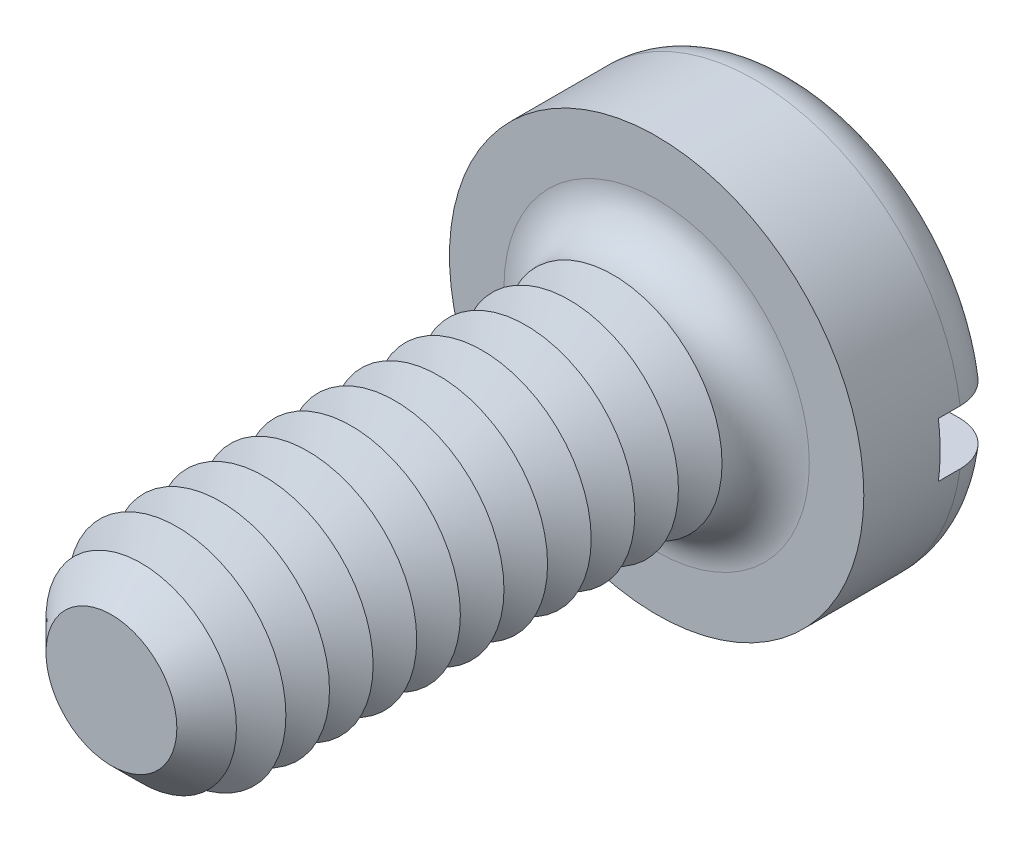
ISO-10303-21;
HEADER;
FILE_DESCRIPTION(('STEP AP214'),'2;1');
FILE_NAME('part.step','',(''),(''),'','','');
FILE_SCHEMA(('AUTOMOTIVE_DESIGN { 1 0 10303 214 1 1 1 1 }'));
ENDSEC;
DATA;
#1=APPLICATION_CONTEXT('core data for automotive mechanical design processes');
#2=APPLICATION_PROTOCOL_DEFINITION('international standard','automotive_design',2000,#1);
#3=PRODUCT_CONTEXT('',#1,'mechanical');
#4=PRODUCT('Part','Part','',(#3));
#5=PRODUCT_RELATED_PRODUCT_CATEGORY('part','',(#4));
#6=PRODUCT_DEFINITION_FORMATION('','',#4);
#7=PRODUCT_DEFINITION_CONTEXT('part definition',#1,'design');
#8=PRODUCT_DEFINITION('design','',#6,#7);
#9=PRODUCT_DEFINITION_SHAPE('','',#8);
#10=(LENGTH_UNIT() NAMED_UNIT(*) SI_UNIT(.MILLI.,.METRE.));
#11=(NAMED_UNIT(*) PLANE_ANGLE_UNIT() SI_UNIT($,.RADIAN.));
#12=(NAMED_UNIT(*) SI_UNIT($,.STERADIAN.) SOLID_ANGLE_UNIT());
#13=UNCERTAINTY_MEASURE_WITH_UNIT(LENGTH_MEASURE(1.E-05),#10,'distance_accuracy_value','');
#14=(GEOMETRIC_REPRESENTATION_CONTEXT(3) GLOBAL_UNCERTAINTY_ASSIGNED_CONTEXT((#13)) GLOBAL_UNIT_ASSIGNED_CONTEXT((#10,
#11,#12)) REPRESENTATION_CONTEXT('',''));
#15=CARTESIAN_POINT('',(0.,0.,0.));
#16=DIRECTION('',(0.,0.,1.));
#17=DIRECTION('',(1.,0.,0.));
#18=AXIS2_PLACEMENT_3D('',#15,#16,#17);
#19=CARTESIAN_POINT('',(0.,0.,-1.3));
#20=DIRECTION('',(0.,0.,1.));
#21=DIRECTION('',(1.,0.,0.));
#22=AXIS2_PLACEMENT_3D('',#19,#20,#21);
#23=PLANE('',#22);
#24=CARTESIAN_POINT('',(0.,0.,-1.3));
#25=DIRECTION('',(0.,0.,1.));
#26=DIRECTION('',(1.,0.,0.));
#27=AXIS2_PLACEMENT_3D('',#24,#25,#26);
#28=CIRCLE('',#27,1.5);
#29=CARTESIAN_POINT('',(-1.4790199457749,0.25,-1.3));
#30=VERTEX_POINT('',#29);
#31=CARTESIAN_POINT('',(1.4790199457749,0.25,-1.3));
#32=VERTEX_POINT('',#31);
#33=EDGE_CURVE('E116',#30,#32,#28,.F.);
#34=ORIENTED_EDGE('',*,*,#33,.T.);
#35=DIRECTION('',(1.,0.,0.));
#36=VECTOR('',#35,1.);
#37=CARTESIAN_POINT('',(-1.9,0.25,-1.3));
#38=LINE('',#37,#36);
#39=EDGE_CURVE('E111',#30,#32,#38,.T.);
#40=ORIENTED_EDGE('',*,*,#39,.F.);
#41=EDGE_LOOP('',(#34,#40));
#42=FACE_BOUND('',#41,.T.);
#43=ADVANCED_FACE('F39',(#42),#23,.F.);
#44=CARTESIAN_POINT('',(0.,0.,-0.9));
#45=DIRECTION('',(0.,0.,1.));
#46=DIRECTION('',(1.,0.,0.));
#47=AXIS2_PLACEMENT_3D('',#44,#45,#46);
#48=TOROIDAL_SURFACE('',#47,1.5,0.4);
#49=CARTESIAN_POINT('',(-1.8150392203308,0.25,-1.12284384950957));
#50=CARTESIAN_POINT('',(-1.80236980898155,0.25,-1.14155059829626));
#51=CARTESIAN_POINT('',(-1.78809920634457,0.25,-1.15919399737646));
#52=CARTESIAN_POINT('',(-1.75677844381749,0.25,-1.19184073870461));
#53=CARTESIAN_POINT('',(-1.73972468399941,0.25,-1.20684060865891));
#54=CARTESIAN_POINT('',(-1.70336024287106,0.25,-1.23375848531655));
#55=CARTESIAN_POINT('',(-1.68405164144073,0.25,-1.24567930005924));
#56=CARTESIAN_POINT('',(-1.64372549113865,0.25,-1.26613528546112));
#57=CARTESIAN_POINT('',(-1.6227083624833,0.25,-1.27467128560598));
#58=CARTESIAN_POINT('',(-1.57937988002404,0.25,-1.2881995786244));
#59=CARTESIAN_POINT('',(-1.55705957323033,0.25,-1.29316318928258));
#60=CARTESIAN_POINT('',(-1.51190394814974,0.25,-1.29931753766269));
#61=CARTESIAN_POINT('',(-1.48906857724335,0.25,-1.3005078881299));
#62=CARTESIAN_POINT('',(-1.4432641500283,0.25,-1.29909058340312));
#63=CARTESIAN_POINT('',(-1.42029638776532,0.25,-1.29644099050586));
#64=CARTESIAN_POINT('',(-1.37512297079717,0.25,-1.28735146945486));
#65=CARTESIAN_POINT('',(-1.3529173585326,0.25,-1.28091133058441));
#66=CARTESIAN_POINT('',(-1.30974098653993,0.25,-1.26436295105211));
#67=CARTESIAN_POINT('',(-1.28877978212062,0.25,-1.25422975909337));
#68=CARTESIAN_POINT('',(-1.24886205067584,0.25,-1.23057736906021));
#69=CARTESIAN_POINT('',(-1.22990554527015,0.25,-1.21705813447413));
#70=CARTESIAN_POINT('',(-1.19461911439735,0.25,-1.18704970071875));
#71=CARTESIAN_POINT('',(-1.17828051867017,0.25,-1.17057070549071));
#72=CARTESIAN_POINT('',(-1.14865897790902,0.25,-1.13506201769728));
#73=CARTESIAN_POINT('',(-1.13537576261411,0.25,-1.11603255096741));
#74=CARTESIAN_POINT('',(-1.11249827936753,0.25,-1.07630328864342));
#75=CARTESIAN_POINT('',(-1.10284494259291,0.25,-1.05563752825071));
#76=CARTESIAN_POINT('',(-1.08724024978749,0.25,-1.01295282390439));
#77=CARTESIAN_POINT('',(-1.08128829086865,0.25,-0.990934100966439));
#78=CARTESIAN_POINT('',(-1.07339124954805,0.25,-0.946722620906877));
#79=CARTESIAN_POINT('',(-1.07135558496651,0.25,-0.924546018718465));
#80=CARTESIAN_POINT('',(-1.07108722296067,0.25,-0.880170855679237));
#81=CARTESIAN_POINT('',(-1.07285419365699,0.25,-0.857972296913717));
#82=CARTESIAN_POINT('',(-1.0800838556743,0.25,-0.814463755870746));
#83=CARTESIAN_POINT('',(-1.08550159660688,0.25,-0.793146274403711));
#84=CARTESIAN_POINT('',(-1.09980522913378,0.25,-0.751709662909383));
#85=CARTESIAN_POINT('',(-1.10869126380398,0.25,-0.731590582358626));
#86=CARTESIAN_POINT('',(-1.12975121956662,0.25,-0.692901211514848));
#87=CARTESIAN_POINT('',(-1.14195627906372,0.25,-0.674347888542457));
#88=CARTESIAN_POINT('',(-1.1692428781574,0.25,-0.639494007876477));
#89=CARTESIAN_POINT('',(-1.18432473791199,0.25,-0.623193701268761));
#90=CARTESIAN_POINT('',(-1.21730350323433,0.25,-0.592916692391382));
#91=CARTESIAN_POINT('',(-1.23525650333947,0.25,-0.579001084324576));
#92=CARTESIAN_POINT('',(-1.27320799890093,0.25,-0.554314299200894));
#93=CARTESIAN_POINT('',(-1.2932067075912,0.25,-0.543543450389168));
#94=CARTESIAN_POINT('',(-1.33509120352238,0.25,-0.525253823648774));
#95=CARTESIAN_POINT('',(-1.35700545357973,0.25,-0.517800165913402));
#96=CARTESIAN_POINT('',(-1.401770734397,0.25,-0.506652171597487));
#97=CARTESIAN_POINT('',(-1.42462180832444,0.25,-0.502958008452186));
#98=CARTESIAN_POINT('',(-1.4707602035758,0.25,-0.499429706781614));
#99=CARTESIAN_POINT('',(-1.49404932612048,0.25,-0.499619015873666));
#100=CARTESIAN_POINT('',(-1.54026206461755,0.25,-0.50392615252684));
#101=CARTESIAN_POINT('',(-1.56318568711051,0.25,-0.508043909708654));
#102=CARTESIAN_POINT('',(-1.60788420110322,0.25,-0.520077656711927));
#103=CARTESIAN_POINT('',(-1.6296645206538,0.25,-0.527973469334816));
#104=CARTESIAN_POINT('',(-1.67156889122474,0.25,-0.547348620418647));
#105=CARTESIAN_POINT('',(-1.69169302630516,0.25,-0.558827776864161));
#106=CARTESIAN_POINT('',(-1.72948251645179,0.25,-0.584913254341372));
#107=CARTESIAN_POINT('',(-1.74717189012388,0.25,-0.599484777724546));
#108=CARTESIAN_POINT('',(-1.77981909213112,0.25,-0.63142070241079));
#109=CARTESIAN_POINT('',(-1.79477707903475,0.25,-0.648784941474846));
#110=CARTESIAN_POINT('',(-1.82136524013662,0.25,-0.685607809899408));
#111=CARTESIAN_POINT('',(-1.83303003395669,0.25,-0.705041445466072));
#112=CARTESIAN_POINT('',(-1.85289960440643,0.25,-0.745602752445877));
#113=CARTESIAN_POINT('',(-1.86110468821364,0.25,-0.76673027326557));
#114=CARTESIAN_POINT('',(-1.87375648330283,0.25,-0.809891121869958));
#115=CARTESIAN_POINT('',(-1.87823381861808,0.25,-0.831915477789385));
#116=CARTESIAN_POINT('',(-1.88341152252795,0.25,-0.87640983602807));
#117=CARTESIAN_POINT('',(-1.88411103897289,0.25,-0.898879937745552));
#118=CARTESIAN_POINT('',(-1.88171559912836,0.25,-0.943534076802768));
#119=CARTESIAN_POINT('',(-1.87863413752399,0.25,-0.965718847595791));
#120=CARTESIAN_POINT('',(-1.86879153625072,0.25,-1.00923650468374));
#121=CARTESIAN_POINT('',(-1.86203494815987,0.25,-1.03057040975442));
#122=CARTESIAN_POINT('',(-1.84837477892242,0.25,-1.06373797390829));
#123=CARTESIAN_POINT('',(-1.84255723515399,0.25,-1.07603047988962));
#124=CARTESIAN_POINT('',(-1.82969924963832,0.25,-1.09995814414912));
#125=CARTESIAN_POINT('',(-1.82265881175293,0.25,-1.11159330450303));
#126=CARTESIAN_POINT('',(-1.8150392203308,0.25,-1.12284384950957));
#127=B_SPLINE_CURVE_WITH_KNOTS('',3,(#49,#50,#51,#52,#53,#54,#55,#56,#57,#58,#59,#60,#61,#62,
#63,#64,#65,#66,#67,#68,#69,#70,#71,#72,#73,#74,#75,#76,#77,#78,#79,#80,#81,#82,#83,#84,#85,#86,
#87,#88,#89,#90,#91,#92,#93,#94,#95,#96,#97,#98,#99,#100,#101,#102,#103,#104,#105,#106,#107,
#108,#109,#110,#111,#112,#113,#114,#115,#116,#117,#118,#119,#120,#121,#122,#123,#124,#125,#126),
.UNSPECIFIED.,.T.,.F.,(4,2,2,2,2,2,2,2,2,2,2,2,2,2,2,2,2,2,2,2,2,2,2,2,2,2,2,2,2,2,2,2,2,2,2,2,
2,2,4),(0.,0.0677296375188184,0.135547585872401,0.203303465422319,0.27104273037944,
0.339319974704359,0.407604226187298,0.47663988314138,0.545679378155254,0.615194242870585,
0.684709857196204,0.753990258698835,0.82326452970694,0.891356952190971,0.959438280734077,
1.02592503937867,1.0924059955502,1.15808300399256,1.2237627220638,1.29008126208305,
1.35640718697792,1.4242376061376,1.49207510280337,1.5611911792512,1.63031044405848,
1.69984715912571,1.76938262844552,1.8385508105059,1.90771547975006,1.97613962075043,
2.04455978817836,2.11223135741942,2.17989691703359,2.24700094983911,2.31412011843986,
2.38100042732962,2.44779809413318,2.48853193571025,2.52926564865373),.UNSPECIFIED.);
#128=CARTESIAN_POINT('',(-1.88348082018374,0.25,-0.9));
#129=VERTEX_POINT('',#128);
#130=EDGE_CURVE('E273',#129,#30,#127,.T.);
#131=ORIENTED_EDGE('',*,*,#130,.F.);
#132=CARTESIAN_POINT('',(0.,0.,-0.9));
#133=DIRECTION('',(0.,0.,1.));
#134=DIRECTION('',(1.,0.,0.));
#135=AXIS2_PLACEMENT_3D('',#132,#133,#134);
#136=CIRCLE('',#135,1.9);
#137=CARTESIAN_POINT('',(1.88348082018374,0.25,-0.9));
#138=VERTEX_POINT('',#137);
#139=EDGE_CURVE('E125',#138,#129,#136,.T.);
#140=ORIENTED_EDGE('',*,*,#139,.F.);
#141=CARTESIAN_POINT('',(1.11362660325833,0.25,-1.07710243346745));
#142=CARTESIAN_POINT('',(1.12388366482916,0.25,-1.09736755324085));
#143=CARTESIAN_POINT('',(1.13589127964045,0.25,-1.11676768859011));
#144=CARTESIAN_POINT('',(1.16301945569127,0.25,-1.15328107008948));
#145=CARTESIAN_POINT('',(1.17814463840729,0.25,-1.17039085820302));
#146=CARTESIAN_POINT('',(1.21101661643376,0.25,-1.20182395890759));
#147=CARTESIAN_POINT('',(1.22875976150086,0.25,-1.21615108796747));
#148=CARTESIAN_POINT('',(1.26636392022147,0.25,-1.24166932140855));
#149=CARTESIAN_POINT('',(1.28622436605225,0.25,-1.25286126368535));
#150=CARTESIAN_POINT('',(1.32781377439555,0.25,-1.27196191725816));
#151=CARTESIAN_POINT('',(1.34956550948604,0.25,-1.27982107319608));
#152=CARTESIAN_POINT('',(1.39407620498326,0.25,-1.29180513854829));
#153=CARTESIAN_POINT('',(1.41683526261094,0.25,-1.29592968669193));
#154=CARTESIAN_POINT('',(1.46288034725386,0.25,-1.3003367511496));
#155=CARTESIAN_POINT('',(1.48616890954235,0.25,-1.30059287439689));
#156=CARTESIAN_POINT('',(1.53245605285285,0.25,-1.29717239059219));
#157=CARTESIAN_POINT('',(1.55545463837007,0.25,-1.29349584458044));
#158=CARTESIAN_POINT('',(1.60038828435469,0.25,-1.28232271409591));
#159=CARTESIAN_POINT('',(1.62232790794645,0.25,-1.27484449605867));
#160=CARTESIAN_POINT('',(1.66461970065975,0.25,-1.25627203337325));
#161=CARTESIAN_POINT('',(1.68497195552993,0.25,-1.24517798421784));
#162=CARTESIAN_POINT('',(1.72328060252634,0.25,-1.21981269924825));
#163=CARTESIAN_POINT('',(1.74126001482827,0.25,-1.2055762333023));
#164=CARTESIAN_POINT('',(1.77453973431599,0.25,-1.17425606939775));
#165=CARTESIAN_POINT('',(1.78984019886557,0.25,-1.1571725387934));
#166=CARTESIAN_POINT('',(1.81715014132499,0.25,-1.12084732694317));
#167=CARTESIAN_POINT('',(1.82919410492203,0.25,-1.10163156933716));
#168=CARTESIAN_POINT('',(1.84985315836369,0.25,-1.06143759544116));
#169=CARTESIAN_POINT('',(1.85846842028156,0.25,-1.04045946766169));
#170=CARTESIAN_POINT('',(1.87195437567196,0.25,-0.997526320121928));
#171=CARTESIAN_POINT('',(1.87685590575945,0.25,-0.975580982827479));
#172=CARTESIAN_POINT('',(1.88288741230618,0.25,-0.931178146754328));
#173=CARTESIAN_POINT('',(1.88401750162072,0.25,-0.908720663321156));
#174=CARTESIAN_POINT('',(1.88247598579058,0.25,-0.864033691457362));
#175=CARTESIAN_POINT('',(1.87982069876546,0.25,-0.841803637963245));
#176=CARTESIAN_POINT('',(1.87081646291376,0.25,-0.798104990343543));
#177=CARTESIAN_POINT('',(1.86446754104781,0.25,-0.776636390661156));
#178=CARTESIAN_POINT('',(1.84826063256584,0.25,-0.735060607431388));
#179=CARTESIAN_POINT('',(1.83840161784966,0.25,-0.714953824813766));
#180=CARTESIAN_POINT('',(1.81546327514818,0.25,-0.676670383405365));
#181=CARTESIAN_POINT('',(1.80238389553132,0.25,-0.658493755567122));
#182=CARTESIAN_POINT('',(1.77331327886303,0.25,-0.62448916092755));
#183=CARTESIAN_POINT('',(1.75730833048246,0.25,-0.608672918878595));
#184=CARTESIAN_POINT('',(1.72289038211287,0.25,-0.579924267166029));
#185=CARTESIAN_POINT('',(1.70447729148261,0.25,-0.566991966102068));
#186=CARTESIAN_POINT('',(1.66559643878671,0.25,-0.544254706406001));
#187=CARTESIAN_POINT('',(1.64511218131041,0.25,-0.53447796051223));
#188=CARTESIAN_POINT('',(1.60280554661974,0.25,-0.518459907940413));
#189=CARTESIAN_POINT('',(1.58098309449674,0.25,-0.512218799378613));
#190=CARTESIAN_POINT('',(1.53636184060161,0.25,-0.503375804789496));
#191=CARTESIAN_POINT('',(1.51355490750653,0.25,-0.500814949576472));
#192=CARTESIAN_POINT('',(1.46783245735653,0.25,-0.499516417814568));
#193=CARTESIAN_POINT('',(1.44491693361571,0.25,-0.500778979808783));
#194=CARTESIAN_POINT('',(1.39937748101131,0.25,-0.50711284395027));
#195=CARTESIAN_POINT('',(1.37675897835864,0.25,-0.512223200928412));
#196=CARTESIAN_POINT('',(1.33269286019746,0.25,-0.526151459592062));
#197=CARTESIAN_POINT('',(1.31124530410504,0.25,-0.534969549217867));
#198=CARTESIAN_POINT('',(1.27004097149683,0.25,-0.556118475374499));
#199=CARTESIAN_POINT('',(1.25029179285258,0.25,-0.568464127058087));
#200=CARTESIAN_POINT('',(1.21316554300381,0.25,-0.59631968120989));
#201=CARTESIAN_POINT('',(1.19578844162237,0.25,-0.611829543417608));
#202=CARTESIAN_POINT('',(1.16406059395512,0.25,-0.645459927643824));
#203=CARTESIAN_POINT('',(1.14968747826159,0.25,-0.663559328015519));
#204=CARTESIAN_POINT('',(1.12425968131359,0.25,-0.70195566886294));
#205=CARTESIAN_POINT('',(1.11320445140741,0.25,-0.722252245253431));
#206=CARTESIAN_POINT('',(1.09497726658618,0.25,-0.764020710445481));
#207=CARTESIAN_POINT('',(1.08772970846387,0.25,-0.785459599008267));
#208=CARTESIAN_POINT('',(1.07702618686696,0.25,-0.829269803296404));
#209=CARTESIAN_POINT('',(1.07357062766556,0.25,-0.851641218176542));
#210=CARTESIAN_POINT('',(1.07060826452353,0.25,-0.896160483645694));
#211=CARTESIAN_POINT('',(1.07101876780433,0.25,-0.918302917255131));
#212=CARTESIAN_POINT('',(1.07557730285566,0.25,-0.962179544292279));
#213=CARTESIAN_POINT('',(1.07972048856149,0.25,-0.983914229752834));
#214=CARTESIAN_POINT('',(1.08912066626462,0.25,-1.01754924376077));
#215=CARTESIAN_POINT('',(1.09320341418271,0.25,-1.02979035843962));
#216=CARTESIAN_POINT('',(1.10254493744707,0.25,-1.05381470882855));
#217=CARTESIAN_POINT('',(1.10780368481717,0.25,-1.06559795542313));
#218=CARTESIAN_POINT('',(1.11362660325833,0.25,-1.07710243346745));
#219=B_SPLINE_CURVE_WITH_KNOTS('',3,(#141,#142,#143,#144,#145,#146,#147,#148,#149,#150,#151,
#152,#153,#154,#155,#156,#157,#158,#159,#160,#161,#162,#163,#164,#165,#166,#167,#168,#169,#170,
#171,#172,#173,#174,#175,#176,#177,#178,#179,#180,#181,#182,#183,#184,#185,#186,#187,#188,#189,
#190,#191,#192,#193,#194,#195,#196,#197,#198,#199,#200,#201,#202,#203,#204,#205,#206,#207,#208,
#209,#210,#211,#212,#213,#214,#215,#216,#217,#218),.UNSPECIFIED.,.T.,.F.,(4,2,2,2,2,2,2,2,2,2,2,
2,2,2,2,2,2,2,2,2,2,2,2,2,2,2,2,2,2,2,2,2,2,2,2,2,2,2,4),(0.,0.0680907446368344,
0.136283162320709,0.204381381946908,0.272461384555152,0.341520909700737,0.410587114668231,
0.480124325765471,0.549660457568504,0.618863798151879,0.688063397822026,0.756532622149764,
0.824997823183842,0.892706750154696,0.960412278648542,1.02754926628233,1.09468424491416,
1.16153068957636,1.22837664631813,1.29524219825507,1.36210882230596,1.42929726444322,
1.49648823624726,1.56426429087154,1.63204414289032,1.70057395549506,1.76910804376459,
1.83834728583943,1.90759003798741,1.97712798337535,2.0466650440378,2.11566422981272,
2.18465199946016,2.25221259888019,2.3197804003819,2.38590630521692,2.45194648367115,
2.49060241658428,2.5292574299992),.UNSPECIFIED.);
#220=EDGE_CURVE('E275',#32,#138,#219,.T.);
#221=ORIENTED_EDGE('',*,*,#220,.F.);
#222=ORIENTED_EDGE('',*,*,#33,.F.);
#223=EDGE_LOOP('',(#131,#140,#221,#222));
#224=FACE_BOUND('',#223,.T.);
#225=ADVANCED_FACE('F257',(#224),#48,.T.);
#226=CARTESIAN_POINT('',(0.,0.,-1.3));
#227=DIRECTION('',(0.,0.,1.));
#228=DIRECTION('',(1.,0.,0.));
#229=AXIS2_PLACEMENT_3D('',#226,#227,#228);
#230=CYLINDRICAL_SURFACE('',#229,1.9);
#231=DIRECTION('',(0.,0.,1.));
#232=VECTOR('',#231,1.);
#233=CARTESIAN_POINT('',(1.88348082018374,0.25,-1.3));
#234=LINE('',#233,#232);
#235=CARTESIAN_POINT('',(1.88348082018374,0.25,-0.7));
#236=VERTEX_POINT('',#235);
#237=EDGE_CURVE('E290',#138,#236,#234,.T.);
#238=ORIENTED_EDGE('',*,*,#237,.F.);
#239=ORIENTED_EDGE('',*,*,#139,.T.);
#240=DIRECTION('',(0.,0.,1.));
#241=VECTOR('',#240,1.);
#242=CARTESIAN_POINT('',(-1.88348082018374,0.25,-1.3));
#243=LINE('',#242,#241);
#244=CARTESIAN_POINT('',(-1.88348082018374,0.25,-0.7));
#245=VERTEX_POINT('',#244);
#246=EDGE_CURVE('E63',#245,#129,#243,.F.);
#247=ORIENTED_EDGE('',*,*,#246,.F.);
#248=CARTESIAN_POINT('',(0.,0.,-0.7));
#249=DIRECTION('',(0.,0.,-1.));
#250=DIRECTION('',(-1.,0.,0.));
#251=AXIS2_PLACEMENT_3D('',#248,#249,#250);
#252=CIRCLE('',#251,1.9);
#253=CARTESIAN_POINT('',(-1.88348082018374,-0.25,-0.7));
#254=VERTEX_POINT('',#253);
#255=EDGE_CURVE('E43',#245,#254,#252,.F.);
#256=ORIENTED_EDGE('',*,*,#255,.T.);
#257=DIRECTION('',(0.,0.,1.));
#258=VECTOR('',#257,1.);
#259=CARTESIAN_POINT('',(-1.88348082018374,-0.25,-1.3));
#260=LINE('',#259,#258);
#261=CARTESIAN_POINT('',(-1.88348082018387,-0.25,-0.899999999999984));
#262=VERTEX_POINT('',#261);
#263=EDGE_CURVE('E287',#262,#254,#260,.T.);
#264=ORIENTED_EDGE('',*,*,#263,.F.);
#265=CARTESIAN_POINT('',(1.88348082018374,-0.25,-0.9));
#266=VERTEX_POINT('',#265);
#267=EDGE_CURVE('E127',#262,#266,#136,.T.);
#268=ORIENTED_EDGE('',*,*,#267,.T.);
#269=DIRECTION('',(0.,0.,1.));
#270=VECTOR('',#269,1.);
#271=CARTESIAN_POINT('',(1.88348082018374,-0.25,-1.3));
#272=LINE('',#271,#270);
#273=CARTESIAN_POINT('',(1.88348082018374,-0.25,-0.7));
#274=VERTEX_POINT('',#273);
#275=EDGE_CURVE('E55',#274,#266,#272,.F.);
#276=ORIENTED_EDGE('',*,*,#275,.F.);
#277=EDGE_CURVE('E11',#274,#236,#252,.F.);
#278=ORIENTED_EDGE('',*,*,#277,.T.);
#279=EDGE_LOOP('',(#238,#239,#247,#256,#264,#268,#276,#278));
#280=FACE_BOUND('',#279,.T.);
#281=CARTESIAN_POINT('',(0.,0.,0.));
#282=DIRECTION('',(0.,0.,1.));
#283=DIRECTION('',(1.,0.,0.));
#284=AXIS2_PLACEMENT_3D('',#281,#282,#283);
#285=CIRCLE('',#284,1.9);
#286=CARTESIAN_POINT('',(1.9,0.,0.));
#287=VERTEX_POINT('',#286);
#288=EDGE_CURVE('E293',#287,#287,#285,.T.);
#289=ORIENTED_EDGE('',*,*,#288,.F.);
#290=EDGE_LOOP('',(#289));
#291=FACE_BOUND('',#290,.T.);
#292=ADVANCED_FACE('F253',(#280,#291),#230,.T.);
#293=CARTESIAN_POINT('',(1.4790199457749,-0.25,-1.3));
#294=VERTEX_POINT('',#293);
#295=CARTESIAN_POINT('',(-1.4790199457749,-0.25,-1.3));
#296=VERTEX_POINT('',#295);
#297=EDGE_CURVE('E109',#294,#296,#28,.F.);
#298=ORIENTED_EDGE('',*,*,#297,.T.);
#299=DIRECTION('',(-1.,0.,0.));
#300=VECTOR('',#299,1.);
#301=CARTESIAN_POINT('',(-1.9,-0.25,-1.3));
#302=LINE('',#301,#300);
#303=EDGE_CURVE('E96',#294,#296,#302,.T.);
#304=ORIENTED_EDGE('',*,*,#303,.F.);
#305=EDGE_LOOP('',(#298,#304));
#306=FACE_BOUND('',#305,.T.);
#307=ADVANCED_FACE('F108',(#306),#23,.F.);
#308=CARTESIAN_POINT('',(0.,0.,0.));
#309=DIRECTION('',(0.,0.,1.));
#310=DIRECTION('',(1.,0.,0.));
#311=AXIS2_PLACEMENT_3D('',#308,#309,#310);
#312=PLANE('',#311);
#313=CARTESIAN_POINT('',(0.,0.,0.));
#314=DIRECTION('',(0.,0.,1.));
#315=DIRECTION('',(1.,0.,0.));
#316=AXIS2_PLACEMENT_3D('',#313,#314,#315);
#317=CIRCLE('',#316,1.4);
#318=CARTESIAN_POINT('',(1.4,0.,0.));
#319=VERTEX_POINT('',#318);
#320=EDGE_CURVE('E115',#319,#319,#317,.F.);
#321=ORIENTED_EDGE('',*,*,#320,.T.);
#322=EDGE_LOOP('',(#321));
#323=FACE_BOUND('',#322,.T.);
#324=ORIENTED_EDGE('',*,*,#288,.T.);
#325=EDGE_LOOP('',(#324));
#326=FACE_BOUND('',#325,.T.);
#327=ADVANCED_FACE('F252',(#323,#326),#312,.T.);
#328=CARTESIAN_POINT('',(-1.8150392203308,-0.25,-1.12284384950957));
#329=CARTESIAN_POINT('',(-1.82756185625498,-0.25,-1.10435021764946));
#330=CARTESIAN_POINT('',(-1.83853807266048,-0.25,-1.08479072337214));
#331=CARTESIAN_POINT('',(-1.85706233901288,-0.25,-1.04409188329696));
#332=CARTESIAN_POINT('',(-1.86460655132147,-0.25,-1.02295079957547));
#333=CARTESIAN_POINT('',(-1.87603074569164,-0.25,-0.979704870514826));
#334=CARTESIAN_POINT('',(-1.87991177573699,-0.25,-0.957600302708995));
#335=CARTESIAN_POINT('',(-1.88389586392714,-0.25,-0.913058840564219));
#336=CARTESIAN_POINT('',(-1.88399981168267,-0.25,-0.890622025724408));
#337=CARTESIAN_POINT('',(-1.88043374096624,-0.25,-0.846104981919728));
#338=CARTESIAN_POINT('',(-1.87677281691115,-0.25,-0.824024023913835));
#339=CARTESIAN_POINT('',(-1.86579880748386,-0.25,-0.780788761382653));
#340=CARTESIAN_POINT('',(-1.85848560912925,-0.25,-0.759634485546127));
#341=CARTESIAN_POINT('',(-1.8404137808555,-0.25,-0.718830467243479));
#342=CARTESIAN_POINT('',(-1.82965205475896,-0.25,-0.699182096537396));
#343=CARTESIAN_POINT('',(-1.80499939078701,-0.25,-0.661958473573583));
#344=CARTESIAN_POINT('',(-1.7911083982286,-0.25,-0.644383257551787));
#345=CARTESIAN_POINT('',(-1.76051564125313,-0.25,-0.611699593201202));
#346=CARTESIAN_POINT('',(-1.74379913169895,-0.25,-0.596604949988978));
#347=CARTESIAN_POINT('',(-1.70808901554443,-0.25,-0.569406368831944));
#348=CARTESIAN_POINT('',(-1.68909532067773,-0.25,-0.557302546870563));
#349=CARTESIAN_POINT('',(-1.64918615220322,-0.25,-0.536307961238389));
#350=CARTESIAN_POINT('',(-1.62825469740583,-0.25,-0.527447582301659));
#351=CARTESIAN_POINT('',(-1.58521203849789,-0.25,-0.513323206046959));
#352=CARTESIAN_POINT('',(-1.5631007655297,-0.25,-0.508059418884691));
#353=CARTESIAN_POINT('',(-1.51806209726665,-0.25,-0.501215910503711));
#354=CARTESIAN_POINT('',(-1.4951283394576,-0.25,-0.499678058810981));
#355=CARTESIAN_POINT('',(-1.4493239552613,-0.25,-0.500434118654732));
#356=CARTESIAN_POINT('',(-1.4264533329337,-0.25,-0.502728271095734));
#357=CARTESIAN_POINT('',(-1.38118643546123,-0.25,-0.511115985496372));
#358=CARTESIAN_POINT('',(-1.35879703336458,-0.25,-0.51724667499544));
#359=CARTESIAN_POINT('',(-1.31535851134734,-0.25,-0.533167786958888));
#360=CARTESIAN_POINT('',(-1.29430945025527,-0.25,-0.542958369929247));
#361=CARTESIAN_POINT('',(-1.25409242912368,-0.25,-0.565968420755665));
#362=CARTESIAN_POINT('',(-1.23493023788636,-0.25,-0.579197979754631));
#363=CARTESIAN_POINT('',(-1.19912477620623,-0.25,-0.608715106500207));
#364=CARTESIAN_POINT('',(-1.18248143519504,-0.25,-0.625002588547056));
#365=CARTESIAN_POINT('',(-1.15237533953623,-0.25,-0.660018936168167));
#366=CARTESIAN_POINT('',(-1.13888343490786,-0.25,-0.678722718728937));
#367=CARTESIAN_POINT('',(-1.115312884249,-0.25,-0.718170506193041));
#368=CARTESIAN_POINT('',(-1.10523377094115,-0.25,-0.738914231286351));
#369=CARTESIAN_POINT('',(-1.08901310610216,-0.25,-0.781372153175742));
#370=CARTESIAN_POINT('',(-1.08279080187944,-0.25,-0.803055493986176));
#371=CARTESIAN_POINT('',(-1.07416105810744,-0.25,-0.847167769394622));
#372=CARTESIAN_POINT('',(-1.07175306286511,-0.25,-0.869596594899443));
#373=CARTESIAN_POINT('',(-1.07084656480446,-0.25,-0.914070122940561));
#374=CARTESIAN_POINT('',(-1.07226874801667,-0.25,-0.936113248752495));
#375=CARTESIAN_POINT('',(-1.07880428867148,-0.25,-0.979644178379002));
#376=CARTESIAN_POINT('',(-1.08391755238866,-0.25,-1.00113199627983));
#377=CARTESIAN_POINT('',(-1.09764616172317,-0.25,-1.04290115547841));
#378=CARTESIAN_POINT('',(-1.10625346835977,-0.25,-1.06318514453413));
#379=CARTESIAN_POINT('',(-1.12669365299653,-0.25,-1.10205584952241));
#380=CARTESIAN_POINT('',(-1.13852679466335,-0.25,-1.12064242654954));
#381=CARTESIAN_POINT('',(-1.16529672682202,-0.25,-1.15594801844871));
#382=CARTESIAN_POINT('',(-1.18028464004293,-0.25,-1.17262825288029));
#383=CARTESIAN_POINT('',(-1.21279183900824,-0.25,-1.20330600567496));
#384=CARTESIAN_POINT('',(-1.23031142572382,-0.25,-1.21730320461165));
#385=CARTESIAN_POINT('',(-1.26781695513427,-0.25,-1.24254670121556));
#386=CARTESIAN_POINT('',(-1.28784999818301,-0.25,-1.25372305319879));
#387=CARTESIAN_POINT('',(-1.3294899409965,-0.25,-1.27260611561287));
#388=CARTESIAN_POINT('',(-1.35109697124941,-0.25,-1.28031253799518));
#389=CARTESIAN_POINT('',(-1.39558575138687,-0.25,-1.29212626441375));
#390=CARTESIAN_POINT('',(-1.4184807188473,-0.25,-1.29618386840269));
#391=CARTESIAN_POINT('',(-1.4646266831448,-0.25,-1.30039947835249));
#392=CARTESIAN_POINT('',(-1.48787767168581,-0.25,-1.30055757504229));
#393=CARTESIAN_POINT('',(-1.53407883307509,-0.25,-1.29695468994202));
#394=CARTESIAN_POINT('',(-1.55702895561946,-0.25,-1.29319306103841));
#395=CARTESIAN_POINT('',(-1.60196718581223,-0.25,-1.28183520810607));
#396=CARTESIAN_POINT('',(-1.62395508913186,-0.25,-1.27423817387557));
#397=CARTESIAN_POINT('',(-1.66614393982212,-0.25,-1.25548646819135));
#398=CARTESIAN_POINT('',(-1.68635782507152,-0.25,-1.24436087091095));
#399=CARTESIAN_POINT('',(-1.72458266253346,-0.25,-1.21884344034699));
#400=CARTESIAN_POINT('',(-1.74259637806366,-0.25,-1.20445577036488));
#401=CARTESIAN_POINT('',(-1.76968989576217,-0.25,-1.1787247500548));
#402=CARTESIAN_POINT('',(-1.77959984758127,-0.25,-1.1682407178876));
#403=CARTESIAN_POINT('',(-1.79823423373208,-0.25,-1.14626700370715));
#404=CARTESIAN_POINT('',(-1.80695867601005,-0.25,-1.1347773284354));
#405=CARTESIAN_POINT('',(-1.8150392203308,-0.25,-1.12284384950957));
#406=B_SPLINE_CURVE_WITH_KNOTS('',3,(#328,#329,#330,#331,#332,#333,#334,#335,#336,#337,#338,
#339,#340,#341,#342,#343,#344,#345,#346,#347,#348,#349,#350,#351,#352,#353,#354,#355,#356,#357,
#358,#359,#360,#361,#362,#363,#364,#365,#366,#367,#368,#369,#370,#371,#372,#373,#374,#375,#376,
#377,#378,#379,#380,#381,#382,#383,#384,#385,#386,#387,#388,#389,#390,#391,#392,#393,#394,#395,
#396,#397,#398,#399,#400,#401,#402,#403,#404,#405),.UNSPECIFIED.,.T.,.F.,(4,2,2,2,2,2,2,2,2,2,2,
2,2,2,2,2,2,2,2,2,2,2,2,2,2,2,2,2,2,2,2,2,2,2,2,2,2,2,4),(0.,0.0669512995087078,
0.133977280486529,0.200984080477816,0.267975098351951,0.334804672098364,0.401636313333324,
0.468528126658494,0.535421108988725,0.602674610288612,0.669930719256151,0.737801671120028,
0.805676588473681,0.87431077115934,0.942949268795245,1.0122625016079,1.08157877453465,
1.15110078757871,1.22062085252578,1.28946987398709,1.35830946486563,1.42565417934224,
1.49298908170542,1.55894041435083,1.62489007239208,1.69068884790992,1.75649300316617,
1.82345932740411,1.89043361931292,1.95893391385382,2.02743989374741,2.09686543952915,
2.16628937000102,2.23572476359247,2.3051748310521,2.3740669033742,2.44287154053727,
2.48607383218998,2.52927583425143),.UNSPECIFIED.);
#407=EDGE_CURVE('E103',#296,#262,#406,.T.);
#408=ORIENTED_EDGE('',*,*,#407,.F.);
#409=ORIENTED_EDGE('',*,*,#297,.F.);
#410=CARTESIAN_POINT('',(1.11362660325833,-0.25,-1.07710243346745));
#411=CARTESIAN_POINT('',(1.10368387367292,-0.25,-1.05745397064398));
#412=CARTESIAN_POINT('',(1.09537204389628,-0.25,-1.0369644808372));
#413=CARTESIAN_POINT('',(1.08229212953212,-0.25,-0.994867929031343));
#414=CARTESIAN_POINT('',(1.07752732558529,-0.25,-0.973259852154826));
#415=CARTESIAN_POINT('',(1.07171197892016,-0.25,-0.929545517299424));
#416=CARTESIAN_POINT('',(1.07066166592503,-0.25,-0.907439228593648));
#417=CARTESIAN_POINT('',(1.07231382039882,-0.25,-0.863372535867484));
#418=CARTESIAN_POINT('',(1.07501551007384,-0.25,-0.841412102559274));
#419=CARTESIAN_POINT('',(1.08404966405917,-0.25,-0.798386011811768));
#420=CARTESIAN_POINT('',(1.09036099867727,-0.25,-0.777315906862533));
#421=CARTESIAN_POINT('',(1.10638973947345,-0.25,-0.736514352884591));
#422=CARTESIAN_POINT('',(1.11610743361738,-0.25,-0.716783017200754));
#423=CARTESIAN_POINT('',(1.13878208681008,-0.25,-0.678952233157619));
#424=CARTESIAN_POINT('',(1.15177705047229,-0.25,-0.660875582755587));
#425=CARTESIAN_POINT('',(1.18055347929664,-0.25,-0.62709692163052));
#426=CARTESIAN_POINT('',(1.19633525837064,-0.25,-0.611395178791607));
#427=CARTESIAN_POINT('',(1.23062926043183,-0.25,-0.582430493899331));
#428=CARTESIAN_POINT('',(1.24919608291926,-0.25,-0.569232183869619));
#429=CARTESIAN_POINT('',(1.28825118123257,-0.25,-0.546076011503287));
#430=CARTESIAN_POINT('',(1.30873964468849,-0.25,-0.536118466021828));
#431=CARTESIAN_POINT('',(1.35144534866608,-0.25,-0.519560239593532));
#432=CARTESIAN_POINT('',(1.3736865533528,-0.25,-0.513021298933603));
#433=CARTESIAN_POINT('',(1.41894945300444,-0.25,-0.503751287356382));
#434=CARTESIAN_POINT('',(1.44197117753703,-0.25,-0.50102036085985));
#435=CARTESIAN_POINT('',(1.48824913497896,-0.25,-0.499449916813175));
#436=CARTESIAN_POINT('',(1.5115059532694,-0.25,-0.500627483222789));
#437=CARTESIAN_POINT('',(1.55748678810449,-0.25,-0.506895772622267));
#438=CARTESIAN_POINT('',(1.58021081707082,-0.25,-0.511986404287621));
#439=CARTESIAN_POINT('',(1.6243247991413,-0.25,-0.525910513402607));
#440=CARTESIAN_POINT('',(1.64572225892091,-0.25,-0.534720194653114));
#441=CARTESIAN_POINT('',(1.68671060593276,-0.25,-0.555845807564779));
#442=CARTESIAN_POINT('',(1.70630159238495,-0.25,-0.568161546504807));
#443=CARTESIAN_POINT('',(1.74289060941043,-0.25,-0.595805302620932));
#444=CARTESIAN_POINT('',(1.75991474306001,-0.25,-0.611098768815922));
#445=CARTESIAN_POINT('',(1.79111916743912,-0.25,-0.644354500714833));
#446=CARTESIAN_POINT('',(1.80529962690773,-0.25,-0.662316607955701));
#447=CARTESIAN_POINT('',(1.83025525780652,-0.25,-0.700191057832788));
#448=CARTESIAN_POINT('',(1.84106535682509,-0.25,-0.720080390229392));
#449=CARTESIAN_POINT('',(1.8591630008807,-0.25,-0.761401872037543));
#450=CARTESIAN_POINT('',(1.86645070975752,-0.25,-0.782833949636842));
#451=CARTESIAN_POINT('',(1.87724305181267,-0.25,-0.826454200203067));
#452=CARTESIAN_POINT('',(1.88077646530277,-0.25,-0.848635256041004));
#453=CARTESIAN_POINT('',(1.88405487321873,-0.25,-0.89327539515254));
#454=CARTESIAN_POINT('',(1.88379996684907,-0.25,-0.915734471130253));
#455=CARTESIAN_POINT('',(1.87951702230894,-0.25,-0.96021054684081));
#456=CARTESIAN_POINT('',(1.87550211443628,-0.25,-0.982228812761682));
#457=CARTESIAN_POINT('',(1.86383665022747,-0.25,-1.0252797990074));
#458=CARTESIAN_POINT('',(1.85618610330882,-0.25,-1.04631252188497));
#459=CARTESIAN_POINT('',(1.83746332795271,-0.25,-1.08682395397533));
#460=CARTESIAN_POINT('',(1.82638722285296,-0.25,-1.10630087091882));
#461=CARTESIAN_POINT('',(1.80113946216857,-0.25,-1.14313202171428));
#462=CARTESIAN_POINT('',(1.78696774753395,-0.25,-1.1604862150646));
#463=CARTESIAN_POINT('',(1.75585044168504,-0.25,-1.19268694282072));
#464=CARTESIAN_POINT('',(1.73888979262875,-0.25,-1.20751892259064));
#465=CARTESIAN_POINT('',(1.7027387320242,-0.25,-1.23415579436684));
#466=CARTESIAN_POINT('',(1.68354822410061,-0.25,-1.24596055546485));
#467=CARTESIAN_POINT('',(1.64329341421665,-0.25,-1.26632784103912));
#468=CARTESIAN_POINT('',(1.62221336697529,-0.25,-1.27485924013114));
#469=CARTESIAN_POINT('',(1.5789301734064,-0.25,-1.28830571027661));
#470=CARTESIAN_POINT('',(1.55672695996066,-0.25,-1.29322056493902));
#471=CARTESIAN_POINT('',(1.5115614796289,-0.25,-1.29935191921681));
#472=CARTESIAN_POINT('',(1.4885934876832,-0.25,-1.30052625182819));
#473=CARTESIAN_POINT('',(1.44278240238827,-0.25,-1.2990417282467));
#474=CARTESIAN_POINT('',(1.41993931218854,-0.25,-1.29638277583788));
#475=CARTESIAN_POINT('',(1.37479511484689,-0.25,-1.28727159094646));
#476=CARTESIAN_POINT('',(1.35250125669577,-0.25,-1.2807834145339));
#477=CARTESIAN_POINT('',(1.30930729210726,-0.25,-1.2641644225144));
#478=CARTESIAN_POINT('',(1.2884075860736,-0.25,-1.25403256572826));
#479=CARTESIAN_POINT('',(1.24854853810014,-0.25,-1.23036781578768));
#480=CARTESIAN_POINT('',(1.22959511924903,-0.25,-1.21682495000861));
#481=CARTESIAN_POINT('',(1.19427766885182,-0.25,-1.18672803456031));
#482=CARTESIAN_POINT('',(1.17791048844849,-0.25,-1.170177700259));
#483=CARTESIAN_POINT('',(1.15346856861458,-0.25,-1.14079355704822));
#484=CARTESIAN_POINT('',(1.14449891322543,-0.25,-1.12869247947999));
#485=CARTESIAN_POINT('',(1.12797460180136,-0.25,-1.10355927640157));
#486=CARTESIAN_POINT('',(1.1204199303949,-0.25,-1.09052716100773));
#487=CARTESIAN_POINT('',(1.11362660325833,-0.25,-1.07710243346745));
#488=B_SPLINE_CURVE_WITH_KNOTS('',3,(#410,#411,#412,#413,#414,#415,#416,#417,#418,#419,#420,
#421,#422,#423,#424,#425,#426,#427,#428,#429,#430,#431,#432,#433,#434,#435,#436,#437,#438,#439,
#440,#441,#442,#443,#444,#445,#446,#447,#448,#449,#450,#451,#452,#453,#454,#455,#456,#457,#458,
#459,#460,#461,#462,#463,#464,#465,#466,#467,#468,#469,#470,#471,#472,#473,#474,#475,#476,#477,
#478,#479,#480,#481,#482,#483,#484,#485,#486,#487),.UNSPECIFIED.,.T.,.F.,(4,2,2,2,2,2,2,2,2,2,2,
2,2,2,2,2,2,2,2,2,2,2,2,2,2,2,2,2,2,2,2,2,2,2,2,2,2,2,4),(0.,0.0660089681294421,
0.132078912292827,0.198152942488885,0.26421327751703,0.329890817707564,0.395573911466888,
0.462056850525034,0.528547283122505,0.596571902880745,0.664603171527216,0.733823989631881,
0.803047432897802,0.872573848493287,0.94209864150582,1.01118516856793,1.08026789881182,
1.14859228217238,1.21691261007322,1.28449938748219,1.35208302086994,1.41914473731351,
1.48620469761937,1.55303134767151,1.61985782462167,1.68676020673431,1.75366386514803,
1.82094137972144,1.88822180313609,1.95612699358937,2.0240362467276,2.09270838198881,
2.16138224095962,2.23071121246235,2.30006001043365,2.36961396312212,2.4390825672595,
2.48418340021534,2.52928374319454),.UNSPECIFIED.);
#489=EDGE_CURVE('E92',#266,#294,#488,.T.);
#490=ORIENTED_EDGE('',*,*,#489,.F.);
#491=ORIENTED_EDGE('',*,*,#267,.F.);
#492=EDGE_LOOP('',(#408,#409,#490,#491));
#493=FACE_BOUND('',#492,.T.);
#494=ADVANCED_FACE('F113',(#493),#48,.T.);
#495=CARTESIAN_POINT('',(0.,0.,0.4));
#496=DIRECTION('',(0.,0.,1.));
#497=DIRECTION('',(1.,0.,0.));
#498=AXIS2_PLACEMENT_3D('',#495,#496,#497);
#499=TOROIDAL_SURFACE('',#498,1.4,0.4);
#500=ORIENTED_EDGE('',*,*,#320,.F.);
#501=EDGE_LOOP('',(#500));
#502=FACE_BOUND('',#501,.T.);
#503=CARTESIAN_POINT('',(0.,0.,0.4));
#504=DIRECTION('',(0.,0.,-1.));
#505=DIRECTION('',(-1.,0.,0.));
#506=AXIS2_PLACEMENT_3D('',#503,#504,#505);
#507=CIRCLE('',#506,1.);
#508=CARTESIAN_POINT('',(-1.,0.,0.4));
#509=VERTEX_POINT('',#508);
#510=EDGE_CURVE('E299',#509,#509,#507,.T.);
#511=ORIENTED_EDGE('',*,*,#510,.T.);
#512=EDGE_LOOP('',(#511));
#513=FACE_BOUND('',#512,.T.);
#514=ADVANCED_FACE('F245',(#502,#513),#499,.F.);
#515=CARTESIAN_POINT('',(0.,0.,0.6));
#516=DIRECTION('',(0.,0.,-1.));
#517=DIRECTION('',(-1.,0.,0.));
#518=AXIS2_PLACEMENT_3D('',#515,#516,#517);
#519=CONICAL_SURFACE('',#518,0.653589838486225,1.0471975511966);
#520=ORIENTED_EDGE('',*,*,#510,.F.);
#521=EDGE_LOOP('',(#520));
#522=FACE_BOUND('',#521,.T.);
#523=CARTESIAN_POINT('',(0.,0.,0.6));
#524=DIRECTION('',(0.,0.,-1.));
#525=DIRECTION('',(-1.,0.,0.));
#526=AXIS2_PLACEMENT_3D('',#523,#524,#525);
#527=CIRCLE('',#526,0.653589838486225);
#528=CARTESIAN_POINT('',(-0.653589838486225,0.,0.6));
#529=VERTEX_POINT('',#528);
#530=EDGE_CURVE('E304',#529,#529,#527,.T.);
#531=ORIENTED_EDGE('',*,*,#530,.T.);
#532=EDGE_LOOP('',(#531));
#533=FACE_BOUND('',#532,.T.);
#534=ADVANCED_FACE('F241',(#522,#533),#519,.T.);
#535=CARTESIAN_POINT('',(0.,0.,0.8));
#536=DIRECTION('',(0.,0.,1.));
#537=DIRECTION('',(1.,0.,0.));
#538=AXIS2_PLACEMENT_3D('',#535,#536,#537);
#539=CONICAL_SURFACE('',#538,1.,1.0471975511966);
#540=ORIENTED_EDGE('',*,*,#530,.F.);
#541=EDGE_LOOP('',(#540));
#542=FACE_BOUND('',#541,.T.);
#543=CARTESIAN_POINT('',(0.,0.,0.8));
#544=DIRECTION('',(0.,0.,-1.));
#545=DIRECTION('',(-1.,0.,0.));
#546=AXIS2_PLACEMENT_3D('',#543,#544,#545);
#547=CIRCLE('',#546,1.);
#548=CARTESIAN_POINT('',(-1.,0.,0.8));
#549=VERTEX_POINT('',#548);
#550=EDGE_CURVE('E309',#549,#549,#547,.T.);
#551=ORIENTED_EDGE('',*,*,#550,.T.);
#552=EDGE_LOOP('',(#551));
#553=FACE_BOUND('',#552,.T.);
#554=ADVANCED_FACE('F237',(#542,#553),#539,.T.);
#555=CARTESIAN_POINT('',(0.,0.,1.));
#556=DIRECTION('',(0.,0.,-1.));
#557=DIRECTION('',(-1.,0.,0.));
#558=AXIS2_PLACEMENT_3D('',#555,#556,#557);
#559=CONICAL_SURFACE('',#558,0.653589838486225,1.0471975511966);
#560=ORIENTED_EDGE('',*,*,#550,.F.);
#561=EDGE_LOOP('',(#560));
#562=FACE_BOUND('',#561,.T.);
#563=CARTESIAN_POINT('',(0.,0.,1.));
#564=DIRECTION('',(0.,0.,-1.));
#565=DIRECTION('',(-1.,0.,0.));
#566=AXIS2_PLACEMENT_3D('',#563,#564,#565);
#567=CIRCLE('',#566,0.653589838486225);
#568=CARTESIAN_POINT('',(-0.653589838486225,0.,1.));
#569=VERTEX_POINT('',#568);
#570=EDGE_CURVE('E313',#569,#569,#567,.T.);
#571=ORIENTED_EDGE('',*,*,#570,.T.);
#572=EDGE_LOOP('',(#571));
#573=FACE_BOUND('',#572,.T.);
#574=ADVANCED_FACE('F233',(#562,#573),#559,.T.);
#575=CARTESIAN_POINT('',(0.,0.,1.2));
#576=DIRECTION('',(0.,0.,1.));
#577=DIRECTION('',(1.,0.,0.));
#578=AXIS2_PLACEMENT_3D('',#575,#576,#577);
#579=CONICAL_SURFACE('',#578,1.,1.0471975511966);
#580=ORIENTED_EDGE('',*,*,#570,.F.);
#581=EDGE_LOOP('',(#580));
#582=FACE_BOUND('',#581,.T.);
#583=CARTESIAN_POINT('',(0.,0.,1.2));
#584=DIRECTION('',(0.,0.,-1.));
#585=DIRECTION('',(-1.,0.,0.));
#586=AXIS2_PLACEMENT_3D('',#583,#584,#585);
#587=CIRCLE('',#586,1.);
#588=CARTESIAN_POINT('',(-1.,0.,1.2));
#589=VERTEX_POINT('',#588);
#590=EDGE_CURVE('E316',#589,#589,#587,.T.);
#591=ORIENTED_EDGE('',*,*,#590,.T.);
#592=EDGE_LOOP('',(#591));
#593=FACE_BOUND('',#592,.T.);
#594=ADVANCED_FACE('F229',(#582,#593),#579,.T.);
#595=CARTESIAN_POINT('',(0.,0.,1.4));
#596=DIRECTION('',(0.,0.,-1.));
#597=DIRECTION('',(-1.,0.,0.));
#598=AXIS2_PLACEMENT_3D('',#595,#596,#597);
#599=CONICAL_SURFACE('',#598,0.653589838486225,1.0471975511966);
#600=ORIENTED_EDGE('',*,*,#590,.F.);
#601=EDGE_LOOP('',(#600));
#602=FACE_BOUND('',#601,.T.);
#603=CARTESIAN_POINT('',(0.,0.,1.4));
#604=DIRECTION('',(0.,0.,-1.));
#605=DIRECTION('',(-1.,0.,0.));
#606=AXIS2_PLACEMENT_3D('',#603,#604,#605);
#607=CIRCLE('',#606,0.653589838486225);
#608=CARTESIAN_POINT('',(-0.653589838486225,0.,1.4));
#609=VERTEX_POINT('',#608);
#610=EDGE_CURVE('E320',#609,#609,#607,.T.);
#611=ORIENTED_EDGE('',*,*,#610,.T.);
#612=EDGE_LOOP('',(#611));
#613=FACE_BOUND('',#612,.T.);
#614=ADVANCED_FACE('F225',(#602,#613),#599,.T.);
#615=CARTESIAN_POINT('',(0.,0.,1.6));
#616=DIRECTION('',(0.,0.,1.));
#617=DIRECTION('',(1.,0.,0.));
#618=AXIS2_PLACEMENT_3D('',#615,#616,#617);
#619=CONICAL_SURFACE('',#618,1.,1.0471975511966);
#620=ORIENTED_EDGE('',*,*,#610,.F.);
#621=EDGE_LOOP('',(#620));
#622=FACE_BOUND('',#621,.T.);
#623=CARTESIAN_POINT('',(0.,0.,1.6));
#624=DIRECTION('',(0.,0.,-1.));
#625=DIRECTION('',(-1.,0.,0.));
#626=AXIS2_PLACEMENT_3D('',#623,#624,#625);
#627=CIRCLE('',#626,1.);
#628=CARTESIAN_POINT('',(-1.,0.,1.6));
#629=VERTEX_POINT('',#628);
#630=EDGE_CURVE('E324',#629,#629,#627,.T.);
#631=ORIENTED_EDGE('',*,*,#630,.T.);
#632=EDGE_LOOP('',(#631));
#633=FACE_BOUND('',#632,.T.);
#634=ADVANCED_FACE('F221',(#622,#633),#619,.T.);
#635=CARTESIAN_POINT('',(0.,0.,1.8));
#636=DIRECTION('',(0.,0.,-1.));
#637=DIRECTION('',(-1.,0.,0.));
#638=AXIS2_PLACEMENT_3D('',#635,#636,#637);
#639=CONICAL_SURFACE('',#638,0.653589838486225,1.0471975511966);
#640=ORIENTED_EDGE('',*,*,#630,.F.);
#641=EDGE_LOOP('',(#640));
#642=FACE_BOUND('',#641,.T.);
#643=CARTESIAN_POINT('',(0.,0.,1.8));
#644=DIRECTION('',(0.,0.,-1.));
#645=DIRECTION('',(-1.,0.,0.));
#646=AXIS2_PLACEMENT_3D('',#643,#644,#645);
#647=CIRCLE('',#646,0.653589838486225);
#648=CARTESIAN_POINT('',(-0.653589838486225,0.,1.8));
#649=VERTEX_POINT('',#648);
#650=EDGE_CURVE('E327',#649,#649,#647,.T.);
#651=ORIENTED_EDGE('',*,*,#650,.T.);
#652=EDGE_LOOP('',(#651));
#653=FACE_BOUND('',#652,.T.);
#654=ADVANCED_FACE('F217',(#642,#653),#639,.T.);
#655=CARTESIAN_POINT('',(0.,0.,2.));
#656=DIRECTION('',(0.,0.,1.));
#657=DIRECTION('',(1.,0.,0.));
#658=AXIS2_PLACEMENT_3D('',#655,#656,#657);
#659=CONICAL_SURFACE('',#658,1.,1.0471975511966);
#660=ORIENTED_EDGE('',*,*,#650,.F.);
#661=EDGE_LOOP('',(#660));
#662=FACE_BOUND('',#661,.T.);
#663=CARTESIAN_POINT('',(0.,0.,2.));
#664=DIRECTION('',(0.,0.,-1.));
#665=DIRECTION('',(-1.,0.,0.));
#666=AXIS2_PLACEMENT_3D('',#663,#664,#665);
#667=CIRCLE('',#666,1.);
#668=CARTESIAN_POINT('',(-1.,0.,2.));
#669=VERTEX_POINT('',#668);
#670=EDGE_CURVE('E331',#669,#669,#667,.T.);
#671=ORIENTED_EDGE('',*,*,#670,.T.);
#672=EDGE_LOOP('',(#671));
#673=FACE_BOUND('',#672,.T.);
#674=ADVANCED_FACE('F213',(#662,#673),#659,.T.);
#675=CARTESIAN_POINT('',(0.,0.,2.2));
#676=DIRECTION('',(0.,0.,-1.));
#677=DIRECTION('',(-1.,0.,0.));
#678=AXIS2_PLACEMENT_3D('',#675,#676,#677);
#679=CONICAL_SURFACE('',#678,0.653589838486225,1.0471975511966);
#680=ORIENTED_EDGE('',*,*,#670,.F.);
#681=EDGE_LOOP('',(#680));
#682=FACE_BOUND('',#681,.T.);
#683=CARTESIAN_POINT('',(0.,0.,2.2));
#684=DIRECTION('',(0.,0.,-1.));
#685=DIRECTION('',(-1.,0.,0.));
#686=AXIS2_PLACEMENT_3D('',#683,#684,#685);
#687=CIRCLE('',#686,0.653589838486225);
#688=CARTESIAN_POINT('',(-0.653589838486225,0.,2.2));
#689=VERTEX_POINT('',#688);
#690=EDGE_CURVE('E335',#689,#689,#687,.T.);
#691=ORIENTED_EDGE('',*,*,#690,.T.);
#692=EDGE_LOOP('',(#691));
#693=FACE_BOUND('',#692,.T.);
#694=ADVANCED_FACE('F209',(#682,#693),#679,.T.);
#695=CARTESIAN_POINT('',(0.,0.,2.4));
#696=DIRECTION('',(0.,0.,1.));
#697=DIRECTION('',(1.,0.,0.));
#698=AXIS2_PLACEMENT_3D('',#695,#696,#697);
#699=CONICAL_SURFACE('',#698,1.,1.0471975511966);
#700=ORIENTED_EDGE('',*,*,#690,.F.);
#701=EDGE_LOOP('',(#700));
#702=FACE_BOUND('',#701,.T.);
#703=CARTESIAN_POINT('',(0.,0.,2.4));
#704=DIRECTION('',(0.,0.,-1.));
#705=DIRECTION('',(-1.,0.,0.));
#706=AXIS2_PLACEMENT_3D('',#703,#704,#705);
#707=CIRCLE('',#706,1.);
#708=CARTESIAN_POINT('',(-1.,0.,2.4));
#709=VERTEX_POINT('',#708);
#710=EDGE_CURVE('E339',#709,#709,#707,.T.);
#711=ORIENTED_EDGE('',*,*,#710,.T.);
#712=EDGE_LOOP('',(#711));
#713=FACE_BOUND('',#712,.T.);
#714=ADVANCED_FACE('F205',(#702,#713),#699,.T.);
#715=CARTESIAN_POINT('',(0.,0.,2.6));
#716=DIRECTION('',(0.,0.,-1.));
#717=DIRECTION('',(-1.,0.,0.));
#718=AXIS2_PLACEMENT_3D('',#715,#716,#717);
#719=CONICAL_SURFACE('',#718,0.653589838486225,1.0471975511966);
#720=ORIENTED_EDGE('',*,*,#710,.F.);
#721=EDGE_LOOP('',(#720));
#722=FACE_BOUND('',#721,.T.);
#723=CARTESIAN_POINT('',(0.,0.,2.6));
#724=DIRECTION('',(0.,0.,-1.));
#725=DIRECTION('',(-1.,0.,0.));
#726=AXIS2_PLACEMENT_3D('',#723,#724,#725);
#727=CIRCLE('',#726,0.653589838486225);
#728=CARTESIAN_POINT('',(-0.653589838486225,0.,2.6));
#729=VERTEX_POINT('',#728);
#730=EDGE_CURVE('E342',#729,#729,#727,.T.);
#731=ORIENTED_EDGE('',*,*,#730,.T.);
#732=EDGE_LOOP('',(#731));
#733=FACE_BOUND('',#732,.T.);
#734=ADVANCED_FACE('F201',(#722,#733),#719,.T.);
#735=CARTESIAN_POINT('',(0.,0.,2.8));
#736=DIRECTION('',(0.,0.,1.));
#737=DIRECTION('',(1.,0.,0.));
#738=AXIS2_PLACEMENT_3D('',#735,#736,#737);
#739=CONICAL_SURFACE('',#738,1.,1.0471975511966);
#740=ORIENTED_EDGE('',*,*,#730,.F.);
#741=EDGE_LOOP('',(#740));
#742=FACE_BOUND('',#741,.T.);
#743=CARTESIAN_POINT('',(0.,0.,2.8));
#744=DIRECTION('',(0.,0.,-1.));
#745=DIRECTION('',(-1.,0.,0.));
#746=AXIS2_PLACEMENT_3D('',#743,#744,#745);
#747=CIRCLE('',#746,1.);
#748=CARTESIAN_POINT('',(-1.,0.,2.8));
#749=VERTEX_POINT('',#748);
#750=EDGE_CURVE('E346',#749,#749,#747,.T.);
#751=ORIENTED_EDGE('',*,*,#750,.T.);
#752=EDGE_LOOP('',(#751));
#753=FACE_BOUND('',#752,.T.);
#754=ADVANCED_FACE('F197',(#742,#753),#739,.T.);
#755=CARTESIAN_POINT('',(0.,0.,3.));
#756=DIRECTION('',(0.,0.,-1.));
#757=DIRECTION('',(-1.,0.,0.));
#758=AXIS2_PLACEMENT_3D('',#755,#756,#757);
#759=CONICAL_SURFACE('',#758,0.653589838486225,1.0471975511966);
#760=ORIENTED_EDGE('',*,*,#750,.F.);
#761=EDGE_LOOP('',(#760));
#762=FACE_BOUND('',#761,.T.);
#763=CARTESIAN_POINT('',(0.,0.,3.));
#764=DIRECTION('',(0.,0.,-1.));
#765=DIRECTION('',(-1.,0.,0.));
#766=AXIS2_PLACEMENT_3D('',#763,#764,#765);
#767=CIRCLE('',#766,0.653589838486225);
#768=CARTESIAN_POINT('',(-0.653589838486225,0.,3.));
#769=VERTEX_POINT('',#768);
#770=EDGE_CURVE('E349',#769,#769,#767,.T.);
#771=ORIENTED_EDGE('',*,*,#770,.T.);
#772=EDGE_LOOP('',(#771));
#773=FACE_BOUND('',#772,.T.);
#774=ADVANCED_FACE('F193',(#762,#773),#759,.T.);
#775=CARTESIAN_POINT('',(0.,0.,3.2));
#776=DIRECTION('',(0.,0.,1.));
#777=DIRECTION('',(1.,0.,0.));
#778=AXIS2_PLACEMENT_3D('',#775,#776,#777);
#779=CONICAL_SURFACE('',#778,1.,1.0471975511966);
#780=ORIENTED_EDGE('',*,*,#770,.F.);
#781=EDGE_LOOP('',(#780));
#782=FACE_BOUND('',#781,.T.);
#783=CARTESIAN_POINT('',(0.,0.,3.2));
#784=DIRECTION('',(0.,0.,-1.));
#785=DIRECTION('',(-1.,0.,0.));
#786=AXIS2_PLACEMENT_3D('',#783,#784,#785);
#787=CIRCLE('',#786,1.);
#788=CARTESIAN_POINT('',(-1.,0.,3.2));
#789=VERTEX_POINT('',#788);
#790=EDGE_CURVE('E353',#789,#789,#787,.T.);
#791=ORIENTED_EDGE('',*,*,#790,.T.);
#792=EDGE_LOOP('',(#791));
#793=FACE_BOUND('',#792,.T.);
#794=ADVANCED_FACE('F189',(#782,#793),#779,.T.);
#795=CARTESIAN_POINT('',(0.,0.,3.4));
#796=DIRECTION('',(0.,0.,-1.));
#797=DIRECTION('',(-1.,0.,0.));
#798=AXIS2_PLACEMENT_3D('',#795,#796,#797);
#799=CONICAL_SURFACE('',#798,0.653589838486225,1.0471975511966);
#800=ORIENTED_EDGE('',*,*,#790,.F.);
#801=EDGE_LOOP('',(#800));
#802=FACE_BOUND('',#801,.T.);
#803=CARTESIAN_POINT('',(0.,0.,3.4));
#804=DIRECTION('',(0.,0.,-1.));
#805=DIRECTION('',(-1.,0.,0.));
#806=AXIS2_PLACEMENT_3D('',#803,#804,#805);
#807=CIRCLE('',#806,0.653589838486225);
#808=CARTESIAN_POINT('',(-0.653589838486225,0.,3.4));
#809=VERTEX_POINT('',#808);
#810=EDGE_CURVE('E357',#809,#809,#807,.T.);
#811=ORIENTED_EDGE('',*,*,#810,.T.);
#812=EDGE_LOOP('',(#811));
#813=FACE_BOUND('',#812,.T.);
#814=ADVANCED_FACE('F185',(#802,#813),#799,.T.);
#815=CARTESIAN_POINT('',(0.,0.,3.6));
#816=DIRECTION('',(0.,0.,1.));
#817=DIRECTION('',(1.,0.,0.));
#818=AXIS2_PLACEMENT_3D('',#815,#816,#817);
#819=CONICAL_SURFACE('',#818,1.,1.0471975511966);
#820=ORIENTED_EDGE('',*,*,#810,.F.);
#821=EDGE_LOOP('',(#820));
#822=FACE_BOUND('',#821,.T.);
#823=CARTESIAN_POINT('',(0.,0.,3.6));
#824=DIRECTION('',(0.,0.,-1.));
#825=DIRECTION('',(-1.,0.,0.));
#826=AXIS2_PLACEMENT_3D('',#823,#824,#825);
#827=CIRCLE('',#826,1.);
#828=CARTESIAN_POINT('',(-1.,0.,3.6));
#829=VERTEX_POINT('',#828);
#830=EDGE_CURVE('E361',#829,#829,#827,.T.);
#831=ORIENTED_EDGE('',*,*,#830,.T.);
#832=EDGE_LOOP('',(#831));
#833=FACE_BOUND('',#832,.T.);
#834=ADVANCED_FACE('F181',(#822,#833),#819,.T.);
#835=CARTESIAN_POINT('',(0.,0.,3.8));
#836=DIRECTION('',(0.,0.,-1.));
#837=DIRECTION('',(-1.,0.,0.));
#838=AXIS2_PLACEMENT_3D('',#835,#836,#837);
#839=CONICAL_SURFACE('',#838,0.653589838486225,1.0471975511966);
#840=ORIENTED_EDGE('',*,*,#830,.F.);
#841=EDGE_LOOP('',(#840));
#842=FACE_BOUND('',#841,.T.);
#843=CARTESIAN_POINT('',(0.,0.,3.8));
#844=DIRECTION('',(0.,0.,-1.));
#845=DIRECTION('',(-1.,0.,0.));
#846=AXIS2_PLACEMENT_3D('',#843,#844,#845);
#847=CIRCLE('',#846,0.653589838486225);
#848=CARTESIAN_POINT('',(-0.653589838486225,0.,3.8));
#849=VERTEX_POINT('',#848);
#850=EDGE_CURVE('E365',#849,#849,#847,.T.);
#851=ORIENTED_EDGE('',*,*,#850,.T.);
#852=EDGE_LOOP('',(#851));
#853=FACE_BOUND('',#852,.T.);
#854=ADVANCED_FACE('F177',(#842,#853),#839,.T.);
#855=CARTESIAN_POINT('',(0.,0.,4.));
#856=DIRECTION('',(0.,0.,1.));
#857=DIRECTION('',(1.,0.,0.));
#858=AXIS2_PLACEMENT_3D('',#855,#856,#857);
#859=CONICAL_SURFACE('',#858,1.,1.0471975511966);
#860=ORIENTED_EDGE('',*,*,#850,.F.);
#861=EDGE_LOOP('',(#860));
#862=FACE_BOUND('',#861,.T.);
#863=CARTESIAN_POINT('',(0.,0.,4.));
#864=DIRECTION('',(0.,0.,-1.));
#865=DIRECTION('',(-1.,0.,0.));
#866=AXIS2_PLACEMENT_3D('',#863,#864,#865);
#867=CIRCLE('',#866,1.);
#868=CARTESIAN_POINT('',(-1.,0.,4.));
#869=VERTEX_POINT('',#868);
#870=EDGE_CURVE('E369',#869,#869,#867,.T.);
#871=ORIENTED_EDGE('',*,*,#870,.T.);
#872=EDGE_LOOP('',(#871));
#873=FACE_BOUND('',#872,.T.);
#874=ADVANCED_FACE('F173',(#862,#873),#859,.T.);
#875=CARTESIAN_POINT('',(0.,0.,4.2));
#876=DIRECTION('',(0.,0.,-1.));
#877=DIRECTION('',(-1.,0.,0.));
#878=AXIS2_PLACEMENT_3D('',#875,#876,#877);
#879=CONICAL_SURFACE('',#878,0.653589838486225,1.0471975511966);
#880=ORIENTED_EDGE('',*,*,#870,.F.);
#881=EDGE_LOOP('',(#880));
#882=FACE_BOUND('',#881,.T.);
#883=CARTESIAN_POINT('',(0.,0.,4.2));
#884=DIRECTION('',(0.,0.,-1.));
#885=DIRECTION('',(-1.,0.,0.));
#886=AXIS2_PLACEMENT_3D('',#883,#884,#885);
#887=CIRCLE('',#886,0.653589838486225);
#888=CARTESIAN_POINT('',(-0.653589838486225,0.,4.2));
#889=VERTEX_POINT('',#888);
#890=EDGE_CURVE('E136',#889,#889,#887,.T.);
#891=ORIENTED_EDGE('',*,*,#890,.T.);
#892=EDGE_LOOP('',(#891));
#893=FACE_BOUND('',#892,.T.);
#894=ADVANCED_FACE('F169',(#882,#893),#879,.T.);
#895=CARTESIAN_POINT('',(0.,0.,4.4));
#896=DIRECTION('',(0.,0.,1.));
#897=DIRECTION('',(1.,0.,0.));
#898=AXIS2_PLACEMENT_3D('',#895,#896,#897);
#899=CONICAL_SURFACE('',#898,1.,1.0471975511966);
#900=ORIENTED_EDGE('',*,*,#890,.F.);
#901=EDGE_LOOP('',(#900));
#902=FACE_BOUND('',#901,.T.);
#903=CARTESIAN_POINT('',(0.,0.,4.4));
#904=DIRECTION('',(0.,0.,-1.));
#905=DIRECTION('',(-1.,0.,0.));
#906=AXIS2_PLACEMENT_3D('',#903,#904,#905);
#907=CIRCLE('',#906,1.);
#908=CARTESIAN_POINT('',(-1.,0.,4.4));
#909=VERTEX_POINT('',#908);
#910=EDGE_CURVE('E137',#909,#909,#907,.T.);
#911=ORIENTED_EDGE('',*,*,#910,.T.);
#912=EDGE_LOOP('',(#911));
#913=FACE_BOUND('',#912,.T.);
#914=ADVANCED_FACE('F165',(#902,#913),#899,.T.);
#915=CARTESIAN_POINT('',(0.,0.,4.6));
#916=DIRECTION('',(0.,0.,-1.));
#917=DIRECTION('',(-1.,0.,0.));
#918=AXIS2_PLACEMENT_3D('',#915,#916,#917);
#919=CONICAL_SURFACE('',#918,0.653589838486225,1.0471975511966);
#920=ORIENTED_EDGE('',*,*,#910,.F.);
#921=EDGE_LOOP('',(#920));
#922=FACE_BOUND('',#921,.T.);
#923=CARTESIAN_POINT('',(0.,0.,4.6));
#924=DIRECTION('',(0.,0.,-1.));
#925=DIRECTION('',(-1.,0.,0.));
#926=AXIS2_PLACEMENT_3D('',#923,#924,#925);
#927=CIRCLE('',#926,0.653589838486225);
#928=CARTESIAN_POINT('',(-0.653589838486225,0.,4.6));
#929=VERTEX_POINT('',#928);
#930=EDGE_CURVE('E379',#929,#929,#927,.T.);
#931=ORIENTED_EDGE('',*,*,#930,.T.);
#932=EDGE_LOOP('',(#931));
#933=FACE_BOUND('',#932,.T.);
#934=ADVANCED_FACE('F161',(#922,#933),#919,.T.);
#935=CARTESIAN_POINT('',(0.,0.,4.8));
#936=DIRECTION('',(0.,0.,1.));
#937=DIRECTION('',(1.,0.,0.));
#938=AXIS2_PLACEMENT_3D('',#935,#936,#937);
#939=CONICAL_SURFACE('',#938,1.,1.0471975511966);
#940=CARTESIAN_POINT('',(0.,0.,4.72679491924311));
#941=DIRECTION('',(0.,0.,1.));
#942=DIRECTION('',(1.,0.,0.));
#943=AXIS2_PLACEMENT_3D('',#940,#941,#942);
#944=CIRCLE('',#943,0.873205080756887);
#945=CARTESIAN_POINT('',(0.873205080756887,0.,4.72679491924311));
#946=VERTEX_POINT('',#945);
#947=EDGE_CURVE('E133',#946,#946,#944,.F.);
#948=ORIENTED_EDGE('',*,*,#947,.T.);
#949=EDGE_LOOP('',(#948));
#950=FACE_BOUND('',#949,.T.);
#951=ORIENTED_EDGE('',*,*,#930,.F.);
#952=EDGE_LOOP('',(#951));
#953=FACE_BOUND('',#952,.T.);
#954=ADVANCED_FACE('F156',(#950,#953),#939,.T.);
#955=CARTESIAN_POINT('',(0.,0.,5.));
#956=DIRECTION('',(0.,0.,1.));
#957=DIRECTION('',(1.,0.,0.));
#958=AXIS2_PLACEMENT_3D('',#955,#956,#957);
#959=PLANE('',#958);
#960=CARTESIAN_POINT('',(0.,0.,5.));
#961=DIRECTION('',(0.,0.,1.));
#962=DIRECTION('',(1.,0.,0.));
#963=AXIS2_PLACEMENT_3D('',#960,#961,#962);
#964=CIRCLE('',#963,0.6);
#965=CARTESIAN_POINT('',(0.6,0.,5.));
#966=VERTEX_POINT('',#965);
#967=EDGE_CURVE('E104',#966,#966,#964,.T.);
#968=ORIENTED_EDGE('',*,*,#967,.T.);
#969=EDGE_LOOP('',(#968));
#970=FACE_BOUND('',#969,.T.);
#971=ADVANCED_FACE('F160',(#970),#959,.T.);
#972=CARTESIAN_POINT('',(0.,0.,5.));
#973=DIRECTION('',(0.,0.,-1.));
#974=DIRECTION('',(-1.,0.,0.));
#975=AXIS2_PLACEMENT_3D('',#972,#973,#974);
#976=CONICAL_SURFACE('',#975,0.6,0.785398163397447);
#977=ORIENTED_EDGE('',*,*,#947,.F.);
#978=EDGE_LOOP('',(#977));
#979=FACE_BOUND('',#978,.T.);
#980=ORIENTED_EDGE('',*,*,#967,.F.);
#981=EDGE_LOOP('',(#980));
#982=FACE_BOUND('',#981,.T.);
#983=ADVANCED_FACE('F41',(#979,#982),#976,.T.);
#984=CARTESIAN_POINT('',(-1.9,0.25,-0.7));
#985=DIRECTION('',(0.,1.,0.));
#986=DIRECTION('',(-1.,0.,0.));
#987=AXIS2_PLACEMENT_3D('',#984,#985,#986);
#988=PLANE('',#987);
#989=ORIENTED_EDGE('',*,*,#246,.T.);
#990=ORIENTED_EDGE('',*,*,#130,.T.);
#991=ORIENTED_EDGE('',*,*,#39,.T.);
#992=ORIENTED_EDGE('',*,*,#220,.T.);
#993=ORIENTED_EDGE('',*,*,#237,.T.);
#994=DIRECTION('',(1.,0.,0.));
#995=VECTOR('',#994,1.);
#996=CARTESIAN_POINT('',(-1.9,0.25,-0.7));
#997=LINE('',#996,#995);
#998=EDGE_CURVE('E387',#245,#236,#997,.T.);
#999=ORIENTED_EDGE('',*,*,#998,.F.);
#1000=EDGE_LOOP('',(#989,#990,#991,#992,#993,#999));
#1001=FACE_BOUND('',#1000,.T.);
#1002=ADVANCED_FACE('F153',(#1001),#988,.F.);
#1003=CARTESIAN_POINT('',(-1.9,-0.25,-0.7));
#1004=DIRECTION('',(0.,-1.,0.));
#1005=DIRECTION('',(1.,0.,0.));
#1006=AXIS2_PLACEMENT_3D('',#1003,#1004,#1005);
#1007=PLANE('',#1006);
#1008=ORIENTED_EDGE('',*,*,#263,.T.);
#1009=DIRECTION('',(-1.,0.,0.));
#1010=VECTOR('',#1009,1.);
#1011=CARTESIAN_POINT('',(-1.9,-0.25,-0.7));
#1012=LINE('',#1011,#1010);
#1013=EDGE_CURVE('E389',#274,#254,#1012,.T.);
#1014=ORIENTED_EDGE('',*,*,#1013,.F.);
#1015=ORIENTED_EDGE('',*,*,#275,.T.);
#1016=ORIENTED_EDGE('',*,*,#489,.T.);
#1017=ORIENTED_EDGE('',*,*,#303,.T.);
#1018=ORIENTED_EDGE('',*,*,#407,.T.);
#1019=EDGE_LOOP('',(#1008,#1014,#1015,#1016,#1017,#1018));
#1020=FACE_BOUND('',#1019,.T.);
#1021=ADVANCED_FACE('F95',(#1020),#1007,.F.);
#1022=CARTESIAN_POINT('',(0.,0.,-0.7));
#1023=DIRECTION('',(0.,0.,-1.));
#1024=DIRECTION('',(-1.,0.,0.));
#1025=AXIS2_PLACEMENT_3D('',#1022,#1023,#1024);
#1026=PLANE('',#1025);
#1027=ORIENTED_EDGE('',*,*,#1013,.T.);
#1028=ORIENTED_EDGE('',*,*,#255,.F.);
#1029=ORIENTED_EDGE('',*,*,#998,.T.);
#1030=ORIENTED_EDGE('',*,*,#277,.F.);
#1031=EDGE_LOOP('',(#1027,#1028,#1029,#1030));
#1032=FACE_BOUND('',#1031,.T.);
#1033=ADVANCED_FACE('F152',(#1032),#1026,.T.);
#1034=CLOSED_SHELL('',(#43,#225,#292,#307,#327,#494,#514,#534,#554,#574,#594,#614,#634,#654,
#674,#694,#714,#734,#754,#774,#794,#814,#834,#854,#874,#894,#914,#934,#954,#971,#983,#1002,
#1021,#1033));
#1035=MANIFOLD_SOLID_BREP('B2',#1034);
#1036=ADVANCED_BREP_SHAPE_REPRESENTATION('',(#18,#1035),#14);
#1037=SHAPE_DEFINITION_REPRESENTATION(#9,#1036);
ENDSEC;
END-ISO-10303-21;
